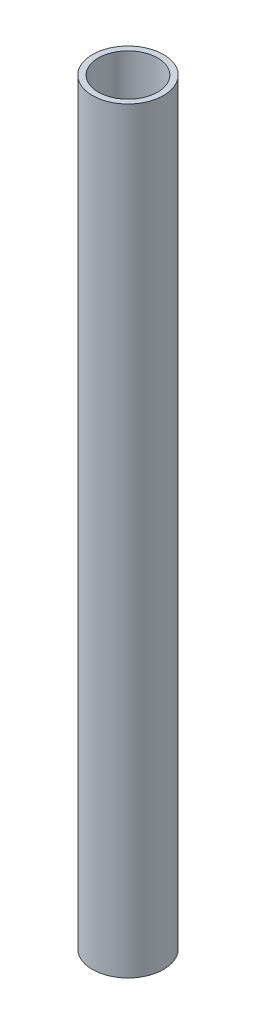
from build123d import *

# Parameters (mm, degrees)
SKETCH1_R      = 16.7005
SKETCH1_R_2    = 13.9319
EXTRUDE1_DEPTH = 355.6


with BuildPart() as part:
    # Sketch1 → Extrude1 (new body)
    with BuildSketch(Plane(origin=(0, 0, 0), x_dir=(1, 0, 0), z_dir=(0, 1, 0))):
        with Locations(Location((0, 0, 0), (0, 0, 270))):
            Circle(SKETCH1_R)
        with Locations(Location((0, 0, 0), (0, 0, 270))):
            Circle(SKETCH1_R_2, mode=Mode.SUBTRACT)
    extrude(amount=EXTRUDE1_DEPTH)


solid = part.part
